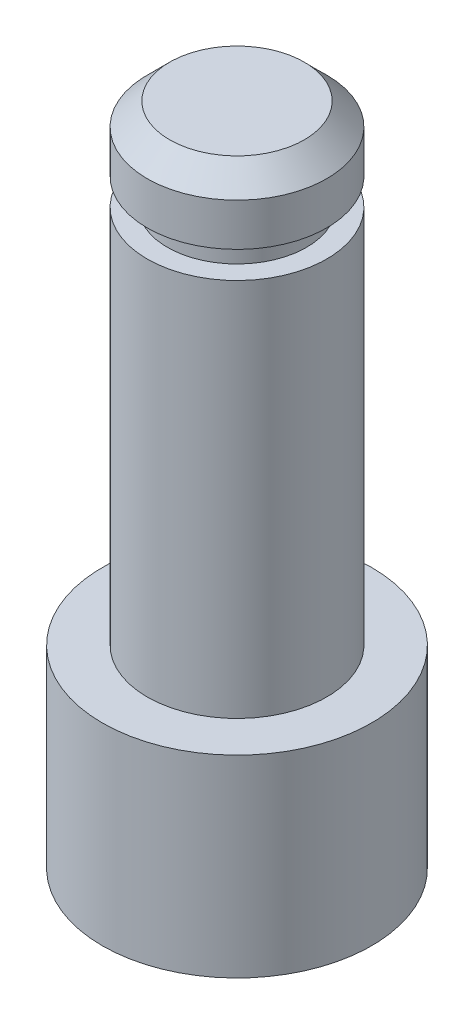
from build123d import *

# Parameters (mm, degrees)
CHANFREIN1_SIZE = 0.5
ESQUISSE2_W     = 1.45
ESQUISSE2_H     = 0.6
COUPE_START     = -15.7
ESQUISSE3_R     = 6
COUPE_DEPTH     = 15.7


with BuildPart() as part:
    # Esquisse1 → R_volution1 (revolve)
    with BuildSketch(Plane.XY, mode=Mode.PRIVATE) as r_volution1_sk:
        Polygon((0, 30.5), (0, 0), (-6, 0), (-6, 2), (-3, 2), (-3, 20), (-2, 20), (-2, 30.5), align=None)
    revolve(r_volution1_sk.sketch.rotate(Axis((0, 0, 0), (0, -1, 0)), 270), axis=Axis((0, 0, 0), (0, -1, 0)))

    # Chanfrein1
    chanfrein1_edges = [part.edges().sort_by_distance(p)[0] for p in [
        (0, 30.5, -2),
    ]]
    chamfer(chanfrein1_edges, length=CHANFREIN1_SIZE)

    # Esquisse2 → Enl_vement de mati_re-R_volution1 (revolve, cut)
    with BuildSketch(Plane.XY, mode=Mode.PRIVATE) as enl_vement_de_mati_re_r_volution1_sk:
        with Locations((-2.275, 28.75)):
            Rectangle(ESQUISSE2_W, ESQUISSE2_H)
    revolve(enl_vement_de_mati_re_r_volution1_sk.sketch.rotate(Axis((0, 0, 0), (0, 1, 0)), 90), axis=Axis((0, 0, 0), (0, 1, 0)), mode=Mode.SUBTRACT)

    # Esquisse3 → Coupe (cut)
    with BuildSketch(Plane.XZ.offset(COUPE_START)):
        Circle(ESQUISSE3_R)
    extrude(amount=COUPE_DEPTH, mode=Mode.SUBTRACT)


solid = part.part
